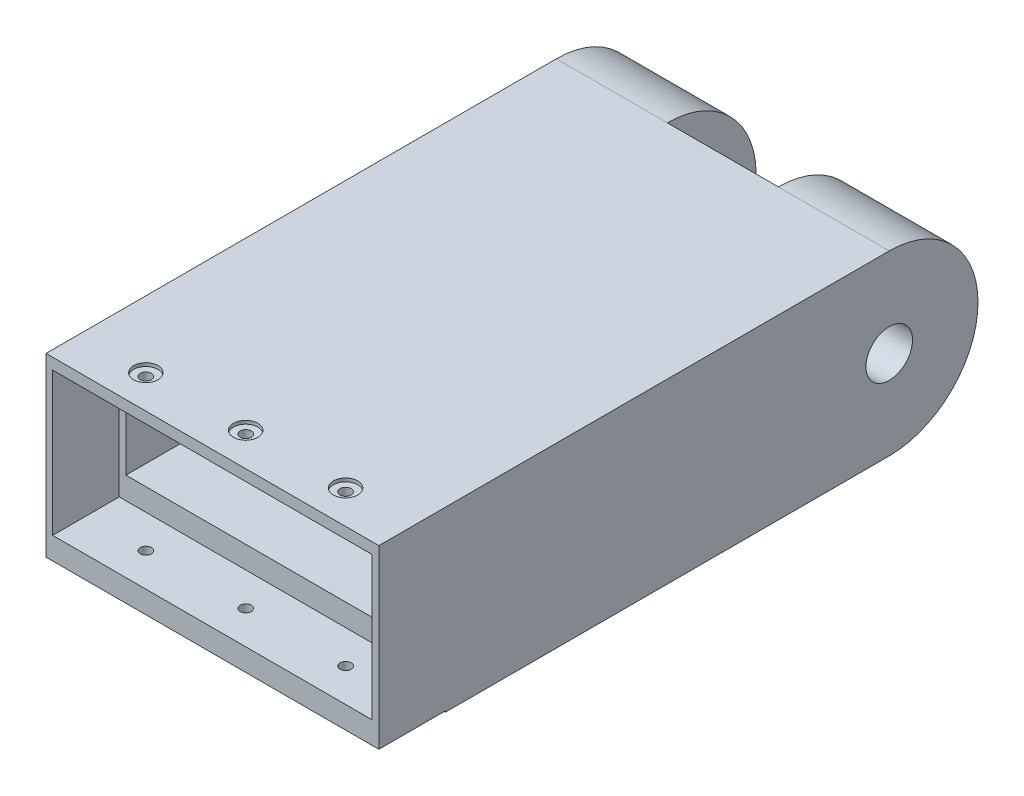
from build123d import *

# Parameters (mm, degrees)
EXTRUDE_1_DEPTH          = 50
EXTRUDE_2_DEPTH          = 50
EXTRUDE_START            = 50
EXTRUDE_3_DEPTH          = 50
CUT_EXTRUDE_START        = -6
CUT_EXTRUDE_1_DEPTH      = 138
CUT_EXTRUDE_2_REACH      = 1400.543
SKETCH_5_W               = 50
SKETCH_5_H               = 40
SKETCH_6_W               = 150
SKETCH_6_H               = 79.492730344
SKETCH_6_W_2             = 144
SKETCH_6_H_2             = 64.492730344
EXTRUDE_4_DEPTH          = 30
SKETCH_7_R               = 5.5
CUT_EXTRUDE_3_DEPTH      = 2.5
CUT_EXTRUDE_4_REACH      = 1430.227
SKETCH_8_R               = 2.5
CUT_EXTRUDE_5_DEPTH      = 1435.995194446
CUT_EXTRUDE_5_DEPTH_BACK = 1435.995194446
SKETCH_9_R               = 10.5
SKETCH_10_R              = 2.5
CUT_EXTRUDE_6_DEPTH      = 10
CUT_EXTRUDE_START_2      = -1.5
SKETCH_12_R              = 5.5
CUT_EXTRUDE_7_DEPTH      = 1.5


with BuildPart() as part:
    # Sketch 1 → Extrude 1 (new body)
    with BuildSketch(Plane(origin=(-32.302393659, 0, 0), x_dir=(0, 0, -1), z_dir=(1, 0, 0))):
        with BuildLine():
            Line((-1190, 62.51739572), (-1390, 62.51739572))
            Line((-1390, 62.51739572), (-1390, 63.024665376))
            Line((-1390, 63.024665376), (-1390, 142.51739572))
            Line((-1390, 142.51739572), (-1190, 142.51739572))
            ThreePointArc((-1190, 142.51739572), (-1150, 102.51739572), (-1190, 62.51739572))
        make_face()
    extrude(amount=EXTRUDE_1_DEPTH)

    # Sketch 2 → Extrude 2 (add)
    with BuildSketch(Plane.ZY.offset(32.302393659)):
        with BuildLine():
            Line((1183.649862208, 78.337326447), (1183.649862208, 63.024665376))
            Line((1183.649862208, 63.024665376), (1390, 63.024665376))
            Line((1390, 63.024665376), (1390, 142.51739572))
            Line((1390, 142.51739572), (1190, 142.51739572))
            Line((1190, 142.51739572), (1190, 127.51739572))
            ThreePointArc((1190, 127.51739572), (1214.794169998, 99.315968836), (1183.649862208, 78.337326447))
        make_face()
    extrude(amount=EXTRUDE_2_DEPTH)

    # Sketch 3 → Extrude 3 (add)
    with BuildSketch(Plane.ZY.offset(82.302393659).offset(EXTRUDE_START)):
        with BuildLine():
            Line((1190, 142.51739572), (1390, 142.51739572))
            Line((1390, 142.51739572), (1390, 63.024665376))
            Line((1390, 63.024665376), (1183.649862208, 63.024665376))
            ThreePointArc((1183.649862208, 63.024665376), (1150.127019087, 105.702579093), (1190, 142.51739572))
        make_face()
    extrude(amount=-EXTRUDE_3_DEPTH)

    # Sketch 4 → Cut-Extrude 1 (cut)
    with BuildSketch(Plane(origin=(17.697606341, 0, 0), x_dir=(0, 0, -1), z_dir=(1, 0, 0)).offset(CUT_EXTRUDE_START)):
        with BuildLine():
            Line((-1205, 132.51739572), (-1390, 132.51739572))
            Line((-1390, 132.51739572), (-1390, 83.024665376))
            Line((-1390, 83.024665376), (-1205.653544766, 83.024665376))
            ThreePointArc((-1205.653544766, 83.024665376), (-1214.996577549, 102.931051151), (-1205, 122.51739572))
            Line((-1205, 122.51739572), (-1205, 132.51739572))
        make_face()
    extrude(amount=-CUT_EXTRUDE_1_DEPTH, mode=Mode.SUBTRACT)

    # Sketch 5 → Cut-Extrude 2 (cut, up to next)
    with BuildSketch(Plane.XZ.offset(-63.024665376), mode=Mode.PRIVATE) as cut_extrude_2_sk1:
        with Locations((-57.302393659, 1203.649862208)):
            Rectangle(SKETCH_5_W, SKETCH_5_H)
    cut_extrude_2_tool1 = extrude(cut_extrude_2_sk1.sketch, amount=-CUT_EXTRUDE_2_REACH, mode=Mode.PRIVATE) & part.part
    add(cut_extrude_2_tool1.solids().sort_by_distance((-57.302394, 63.024665, 1203.649862))[0], mode=Mode.SUBTRACT)

    # Sketch 6 → Extrude 4 (add)
    with BuildSketch(Plane.XY.offset(1390)):
        with Locations((-57.302393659, 102.771030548)):
            Rectangle(SKETCH_6_W, SKETCH_6_H)
        with Locations((-57.302393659, 105.271030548)):
            Rectangle(SKETCH_6_W_2, SKETCH_6_H_2, mode=Mode.SUBTRACT)
    extrude(amount=EXTRUDE_4_DEPTH)

    # Sketch 7 → Cut-Extrude 3 (cut)
    with BuildSketch(Plane.XZ.offset(-63.024665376)):
        with Locations((-102.302393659, 1405)):
            Circle(SKETCH_7_R)
        with Locations((-57.302393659, 1405)):
            Circle(SKETCH_7_R)
        with Locations((-12.302393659, 1405)):
            Circle(SKETCH_7_R)
    extrude(amount=-CUT_EXTRUDE_3_DEPTH, mode=Mode.SUBTRACT)

    # Sketch 8 → Cut-Extrude 4 (cut, up to next)
    with BuildSketch(Plane.XZ.offset(-65.524665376), mode=Mode.PRIVATE) as cut_extrude_4_sk1:
        with Locations((-102.302393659, 1405)):
            Circle(SKETCH_8_R)
    cut_extrude_4_tool1 = extrude(cut_extrude_4_sk1.sketch, amount=-CUT_EXTRUDE_4_REACH, mode=Mode.PRIVATE) & part.part
    # Sketch 8 → Cut-Extrude 4 (cut, up to next)
    with BuildSketch(Plane.XZ.offset(-65.524665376), mode=Mode.PRIVATE) as cut_extrude_4_sk2:
        with Locations((-57.302393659, 1405)):
            Circle(SKETCH_8_R)
    cut_extrude_4_tool2 = extrude(cut_extrude_4_sk2.sketch, amount=-CUT_EXTRUDE_4_REACH, mode=Mode.PRIVATE) & part.part
    # Sketch 8 → Cut-Extrude 4 (cut, up to next)
    with BuildSketch(Plane.XZ.offset(-65.524665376), mode=Mode.PRIVATE) as cut_extrude_4_sk3:
        with Locations((-12.302393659, 1405)):
            Circle(SKETCH_8_R)
    cut_extrude_4_tool3 = extrude(cut_extrude_4_sk3.sketch, amount=-CUT_EXTRUDE_4_REACH, mode=Mode.PRIVATE) & part.part
    add(cut_extrude_4_tool1.solids().sort_by_distance((-102.302394, 65.524665, 1405))[0], mode=Mode.SUBTRACT)
    add(cut_extrude_4_tool2.solids().sort_by_distance((-57.302394, 65.524665, 1405))[0], mode=Mode.SUBTRACT)
    add(cut_extrude_4_tool3.solids().sort_by_distance((-12.302394, 65.524665, 1405))[0], mode=Mode.SUBTRACT)

    # Sketch 9 → Cut-Extrude 5 (cut, two sides: drawn at the far end of the back side and taken through both)
    with BuildSketch(Plane.ZY.offset(132.302393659).offset(-CUT_EXTRUDE_5_DEPTH_BACK)):
        with Locations((1190, 102.51739572)):
            Circle(SKETCH_9_R)
    extrude(amount=CUT_EXTRUDE_5_DEPTH + CUT_EXTRUDE_5_DEPTH_BACK, mode=Mode.SUBTRACT)

    # Sketch 10 → Cut-Extrude 6 (cut)
    with BuildSketch(Plane.XZ.offset(-137.51739572)):
        with Locations((-102.302393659, 1405)):
            Circle(SKETCH_10_R)
        with Locations((-57.302393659, 1405)):
            Circle(SKETCH_10_R)
        with Locations((-12.302393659, 1405)):
            Circle(SKETCH_10_R)
    extrude(amount=-CUT_EXTRUDE_6_DEPTH, mode=Mode.SUBTRACT)

    # Sketch 12 → Cut-Extrude 7 (cut)
    with BuildSketch(Plane(origin=(0, 142.51739572, 0), x_dir=(1, 0, 0), z_dir=(0, 1, 0)).offset(CUT_EXTRUDE_START_2)):
        with Locations((-12.302393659, -1405)):
            Circle(SKETCH_12_R)
        with Locations((-57.302393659, -1405)):
            Circle(SKETCH_12_R)
        with Locations((-102.302393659, -1405)):
            Circle(SKETCH_12_R)
    extrude(amount=CUT_EXTRUDE_7_DEPTH, mode=Mode.SUBTRACT)


solid = part.part
